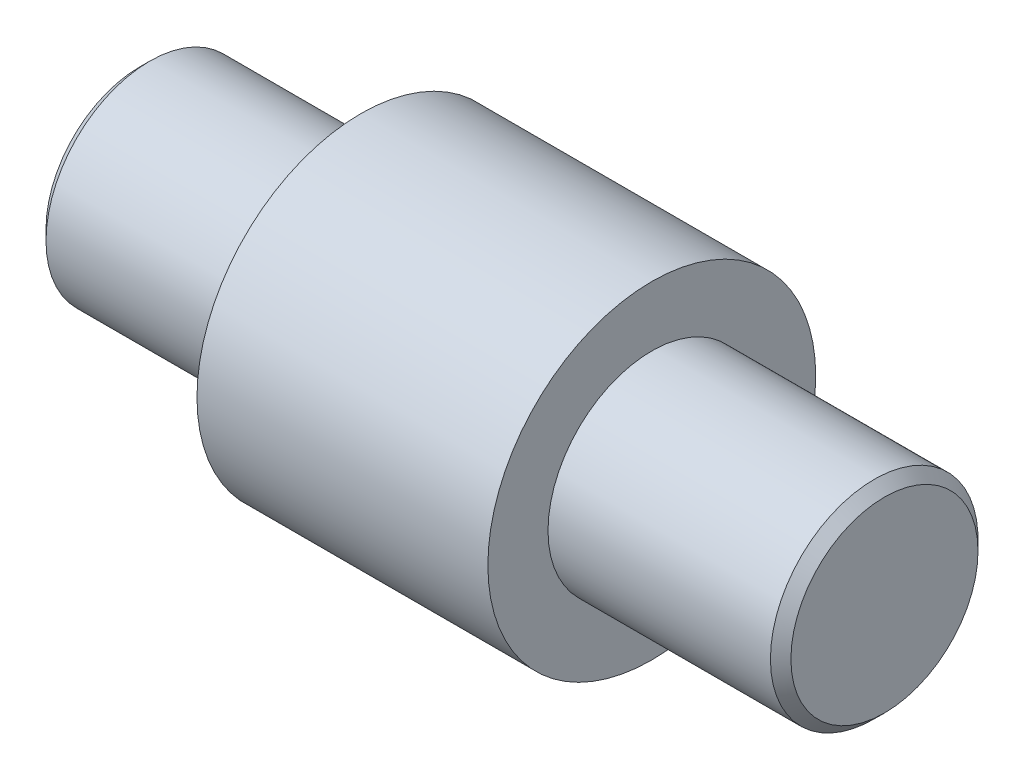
ISO-10303-21;
HEADER;
FILE_DESCRIPTION(('STEP AP214'),'2;1');
FILE_NAME('part.step','',(''),(''),'','','');
FILE_SCHEMA(('AUTOMOTIVE_DESIGN { 1 0 10303 214 1 1 1 1 }'));
ENDSEC;
DATA;
#1=APPLICATION_CONTEXT('core data for automotive mechanical design processes');
#2=APPLICATION_PROTOCOL_DEFINITION('international standard','automotive_design',2000,#1);
#3=PRODUCT_CONTEXT('',#1,'mechanical');
#4=PRODUCT('Part','Part','',(#3));
#5=PRODUCT_RELATED_PRODUCT_CATEGORY('part','',(#4));
#6=PRODUCT_DEFINITION_FORMATION('','',#4);
#7=PRODUCT_DEFINITION_CONTEXT('part definition',#1,'design');
#8=PRODUCT_DEFINITION('design','',#6,#7);
#9=PRODUCT_DEFINITION_SHAPE('','',#8);
#10=(LENGTH_UNIT() NAMED_UNIT(*) SI_UNIT(.MILLI.,.METRE.));
#11=(NAMED_UNIT(*) PLANE_ANGLE_UNIT() SI_UNIT($,.RADIAN.));
#12=(NAMED_UNIT(*) SI_UNIT($,.STERADIAN.) SOLID_ANGLE_UNIT());
#13=UNCERTAINTY_MEASURE_WITH_UNIT(LENGTH_MEASURE(1.E-05),#10,'distance_accuracy_value','');
#14=(GEOMETRIC_REPRESENTATION_CONTEXT(3) GLOBAL_UNCERTAINTY_ASSIGNED_CONTEXT((#13)) GLOBAL_UNIT_ASSIGNED_CONTEXT((#10,
#11,#12)) REPRESENTATION_CONTEXT('',''));
#15=CARTESIAN_POINT('',(0.,0.,0.));
#16=DIRECTION('',(0.,0.,1.));
#17=DIRECTION('',(1.,0.,0.));
#18=AXIS2_PLACEMENT_3D('',#15,#16,#17);
#19=CARTESIAN_POINT('',(104.709234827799,-135.985268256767,0.));
#20=DIRECTION('',(-1.,0.,0.));
#21=DIRECTION('',(0.,0.,1.));
#22=AXIS2_PLACEMENT_3D('',#19,#20,#21);
#23=PLANE('',#22);
#24=CARTESIAN_POINT('',(104.709234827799,-135.985268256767,0.));
#25=DIRECTION('',(-1.,0.,0.));
#26=DIRECTION('',(0.,0.,1.));
#27=AXIS2_PLACEMENT_3D('',#24,#25,#26);
#28=CIRCLE('',#27,9.13043506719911);
#29=CARTESIAN_POINT('',(104.709234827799,-135.985268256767,9.13043506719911));
#30=VERTEX_POINT('',#29);
#31=EDGE_CURVE('E10',#30,#30,#28,.F.);
#32=ORIENTED_EDGE('',*,*,#31,.T.);
#33=EDGE_LOOP('',(#32));
#34=FACE_BOUND('',#33,.T.);
#35=ADVANCED_FACE('F32',(#34),#23,.F.);
#36=CARTESIAN_POINT('',(45.7932022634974,-135.985268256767,0.));
#37=DIRECTION('',(-1.,0.,0.));
#38=DIRECTION('',(0.,0.,1.));
#39=AXIS2_PLACEMENT_3D('',#36,#37,#38);
#40=CYLINDRICAL_SURFACE('',#39,10.1304350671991);
#41=CARTESIAN_POINT('',(103.709234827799,-135.985268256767,0.));
#42=DIRECTION('',(-1.,0.,0.));
#43=DIRECTION('',(0.,0.,1.));
#44=AXIS2_PLACEMENT_3D('',#41,#42,#43);
#45=CIRCLE('',#44,10.1304350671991);
#46=CARTESIAN_POINT('',(103.709234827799,-135.985268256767,10.1304350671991));
#47=VERTEX_POINT('',#46);
#48=EDGE_CURVE('E39',#47,#47,#45,.T.);
#49=ORIENTED_EDGE('',*,*,#48,.T.);
#50=EDGE_LOOP('',(#49));
#51=FACE_BOUND('',#50,.T.);
#52=CARTESIAN_POINT('',(81.9999999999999,-135.985268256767,0.));
#53=DIRECTION('',(-1.,0.,0.));
#54=DIRECTION('',(0.,0.,1.));
#55=AXIS2_PLACEMENT_3D('',#52,#53,#54);
#56=CIRCLE('',#55,10.1304350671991);
#57=CARTESIAN_POINT('',(81.9999999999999,-135.985268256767,10.1304350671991));
#58=VERTEX_POINT('',#57);
#59=EDGE_CURVE('E52',#58,#58,#56,.T.);
#60=ORIENTED_EDGE('',*,*,#59,.F.);
#61=EDGE_LOOP('',(#60));
#62=FACE_BOUND('',#61,.T.);
#63=ADVANCED_FACE('F82',(#51,#62),#40,.T.);
#64=CARTESIAN_POINT('',(81.9999999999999,-119.985268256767,0.));
#65=DIRECTION('',(-1.,0.,0.));
#66=DIRECTION('',(0.,0.,1.));
#67=AXIS2_PLACEMENT_3D('',#64,#65,#66);
#68=PLANE('',#67);
#69=CARTESIAN_POINT('',(81.9999999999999,-135.985268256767,0.));
#70=DIRECTION('',(-1.,0.,0.));
#71=DIRECTION('',(0.,0.,1.));
#72=AXIS2_PLACEMENT_3D('',#69,#70,#71);
#73=CIRCLE('',#72,16.);
#74=CARTESIAN_POINT('',(81.9999999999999,-135.985268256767,16.));
#75=VERTEX_POINT('',#74);
#76=EDGE_CURVE('E55',#75,#75,#73,.T.);
#77=ORIENTED_EDGE('',*,*,#76,.F.);
#78=EDGE_LOOP('',(#77));
#79=FACE_BOUND('',#78,.T.);
#80=ORIENTED_EDGE('',*,*,#59,.T.);
#81=EDGE_LOOP('',(#80));
#82=FACE_BOUND('',#81,.T.);
#83=ADVANCED_FACE('F76',(#79,#82),#68,.F.);
#84=CARTESIAN_POINT('',(45.7932022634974,-135.985268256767,0.));
#85=DIRECTION('',(-1.,0.,0.));
#86=DIRECTION('',(0.,0.,1.));
#87=AXIS2_PLACEMENT_3D('',#84,#85,#86);
#88=CYLINDRICAL_SURFACE('',#87,16.);
#89=CARTESIAN_POINT('',(53.6070429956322,-135.985268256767,0.));
#90=DIRECTION('',(-1.,0.,0.));
#91=DIRECTION('',(0.,0.,1.));
#92=AXIS2_PLACEMENT_3D('',#89,#90,#91);
#93=CIRCLE('',#92,16.);
#94=CARTESIAN_POINT('',(53.6070429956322,-135.985268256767,16.));
#95=VERTEX_POINT('',#94);
#96=EDGE_CURVE('E58',#95,#95,#93,.T.);
#97=ORIENTED_EDGE('',*,*,#96,.F.);
#98=EDGE_LOOP('',(#97));
#99=FACE_BOUND('',#98,.T.);
#100=ORIENTED_EDGE('',*,*,#76,.T.);
#101=EDGE_LOOP('',(#100));
#102=FACE_BOUND('',#101,.T.);
#103=ADVANCED_FACE('F70',(#99,#102),#88,.T.);
#104=CARTESIAN_POINT('',(53.6070429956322,-119.985268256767,0.));
#105=DIRECTION('',(1.,0.,0.));
#106=DIRECTION('',(0.,0.,-1.));
#107=AXIS2_PLACEMENT_3D('',#104,#105,#106);
#108=PLANE('',#107);
#109=CARTESIAN_POINT('',(53.6070429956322,-135.985268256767,0.));
#110=DIRECTION('',(-1.,0.,0.));
#111=DIRECTION('',(0.,0.,1.));
#112=AXIS2_PLACEMENT_3D('',#109,#110,#111);
#113=CIRCLE('',#112,10.1304350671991);
#114=CARTESIAN_POINT('',(53.6070429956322,-135.985268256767,10.1304350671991));
#115=VERTEX_POINT('',#114);
#116=EDGE_CURVE('E61',#115,#115,#113,.T.);
#117=ORIENTED_EDGE('',*,*,#116,.F.);
#118=EDGE_LOOP('',(#117));
#119=FACE_BOUND('',#118,.T.);
#120=ORIENTED_EDGE('',*,*,#96,.T.);
#121=EDGE_LOOP('',(#120));
#122=FACE_BOUND('',#121,.T.);
#123=ADVANCED_FACE('F67',(#119,#122),#108,.F.);
#124=CARTESIAN_POINT('',(45.7932022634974,-135.985268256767,0.));
#125=DIRECTION('',(-1.,0.,0.));
#126=DIRECTION('',(0.,0.,1.));
#127=AXIS2_PLACEMENT_3D('',#124,#125,#126);
#128=CYLINDRICAL_SURFACE('',#127,10.1304350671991);
#129=CARTESIAN_POINT('',(32.9999999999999,-135.985268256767,0.));
#130=DIRECTION('',(1.,0.,0.));
#131=DIRECTION('',(0.,0.,-1.));
#132=AXIS2_PLACEMENT_3D('',#129,#130,#131);
#133=CIRCLE('',#132,10.1304350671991);
#134=CARTESIAN_POINT('',(32.9999999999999,-135.985268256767,-10.1304350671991));
#135=VERTEX_POINT('',#134);
#136=EDGE_CURVE('E43',#135,#135,#133,.T.);
#137=ORIENTED_EDGE('',*,*,#136,.T.);
#138=EDGE_LOOP('',(#137));
#139=FACE_BOUND('',#138,.T.);
#140=ORIENTED_EDGE('',*,*,#116,.T.);
#141=EDGE_LOOP('',(#140));
#142=FACE_BOUND('',#141,.T.);
#143=ADVANCED_FACE('F65',(#139,#142),#128,.T.);
#144=CARTESIAN_POINT('',(31.9999999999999,-125.854833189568,0.));
#145=DIRECTION('',(1.,0.,0.));
#146=DIRECTION('',(0.,0.,-1.));
#147=AXIS2_PLACEMENT_3D('',#144,#145,#146);
#148=PLANE('',#147);
#149=CARTESIAN_POINT('',(31.9999999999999,-135.985268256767,0.));
#150=DIRECTION('',(1.,0.,0.));
#151=DIRECTION('',(0.,0.,-1.));
#152=AXIS2_PLACEMENT_3D('',#149,#150,#151);
#153=CIRCLE('',#152,9.1304350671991);
#154=CARTESIAN_POINT('',(31.9999999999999,-135.985268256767,-9.1304350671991));
#155=VERTEX_POINT('',#154);
#156=EDGE_CURVE('E47',#155,#155,#153,.F.);
#157=ORIENTED_EDGE('',*,*,#156,.T.);
#158=EDGE_LOOP('',(#157));
#159=FACE_BOUND('',#158,.T.);
#160=ADVANCED_FACE('F94',(#159),#148,.F.);
#161=CARTESIAN_POINT('',(31.9999999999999,-135.985268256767,0.));
#162=DIRECTION('',(1.,0.,0.));
#163=DIRECTION('',(0.,0.,-1.));
#164=AXIS2_PLACEMENT_3D('',#161,#162,#163);
#165=CONICAL_SURFACE('',#164,9.1304350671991,0.785398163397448);
#166=ORIENTED_EDGE('',*,*,#136,.F.);
#167=EDGE_LOOP('',(#166));
#168=FACE_BOUND('',#167,.T.);
#169=ORIENTED_EDGE('',*,*,#156,.F.);
#170=EDGE_LOOP('',(#169));
#171=FACE_BOUND('',#170,.T.);
#172=ADVANCED_FACE('F92',(#168,#171),#165,.T.);
#173=CARTESIAN_POINT('',(103.709234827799,-135.985268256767,0.));
#174=DIRECTION('',(-1.,0.,0.));
#175=DIRECTION('',(0.,0.,1.));
#176=AXIS2_PLACEMENT_3D('',#173,#174,#175);
#177=CONICAL_SURFACE('',#176,10.1304350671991,0.785398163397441);
#178=ORIENTED_EDGE('',*,*,#31,.F.);
#179=EDGE_LOOP('',(#178));
#180=FACE_BOUND('',#179,.T.);
#181=ORIENTED_EDGE('',*,*,#48,.F.);
#182=EDGE_LOOP('',(#181));
#183=FACE_BOUND('',#182,.T.);
#184=ADVANCED_FACE('F34',(#180,#183),#177,.T.);
#185=CLOSED_SHELL('',(#35,#63,#83,#103,#123,#143,#160,#172,#184));
#186=MANIFOLD_SOLID_BREP('B2',#185);
#187=ADVANCED_BREP_SHAPE_REPRESENTATION('',(#18,#186),#14);
#188=SHAPE_DEFINITION_REPRESENTATION(#9,#187);
ENDSEC;
END-ISO-10303-21;
